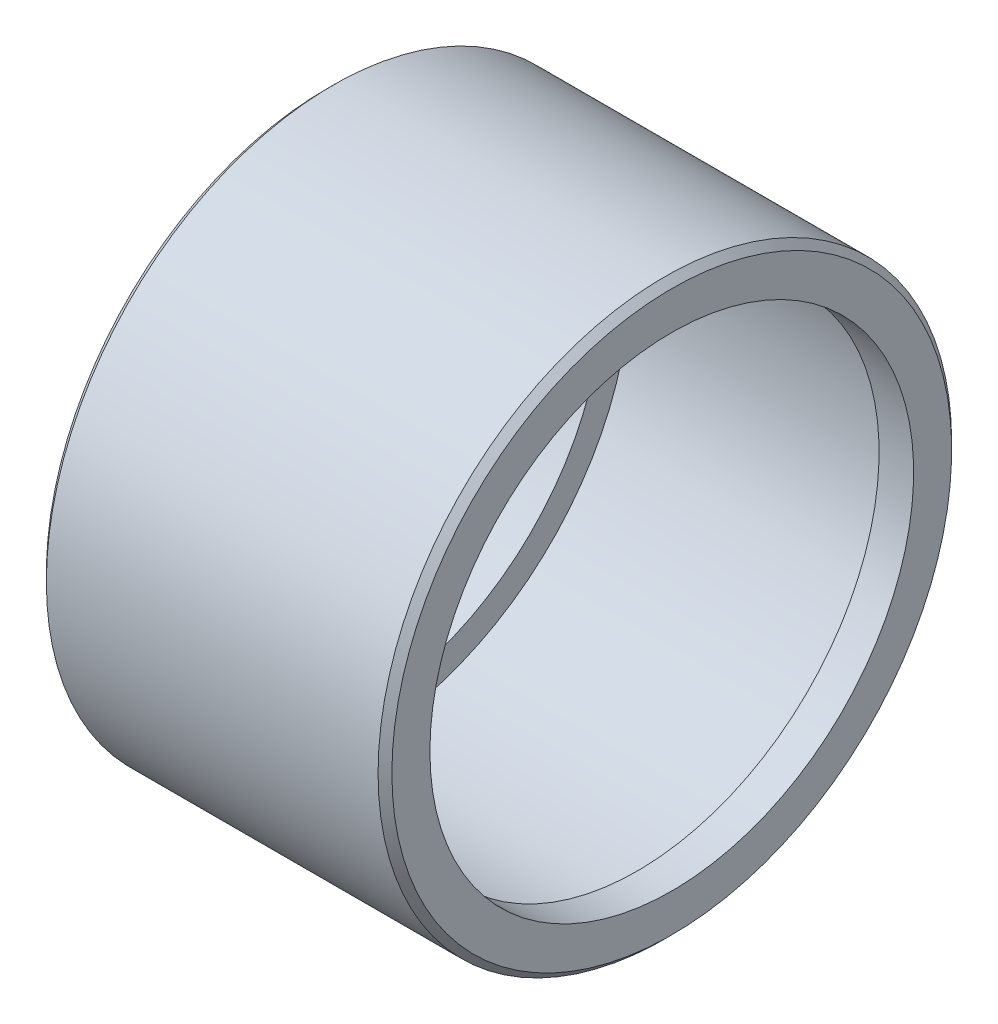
from build123d import *

# Parameters (mm, degrees)
CHANFREIN1_SIZE = 0.1


with BuildPart() as part:
    # Esquisse2 → R_volution1 (revolve)
    with BuildSketch(Plane.XY, mode=Mode.PRIVATE) as r_volution1_sk:
        Polygon((5, 4.15), (5, 3.5), (4.5, 3.5), (4.5, 3.9), (0.5, 3.9), (0.5, 3.5), (0, 3.5), (0, 4.15), align=None)
    revolve(r_volution1_sk.sketch.rotate(Axis((-4.556427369, 0, 0), (1, 0, 0)), 90), axis=Axis((-4.556427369, 0, 0), (1, 0, 0)))

    # Chanfrein1
    chanfrein1_edges = [part.edges().sort_by_distance(p)[0] for p in [
        (0, 0, -4.15),
        (5, 0, -4.15),
    ]]
    chamfer(chanfrein1_edges, length=CHANFREIN1_SIZE)


solid = part.part
